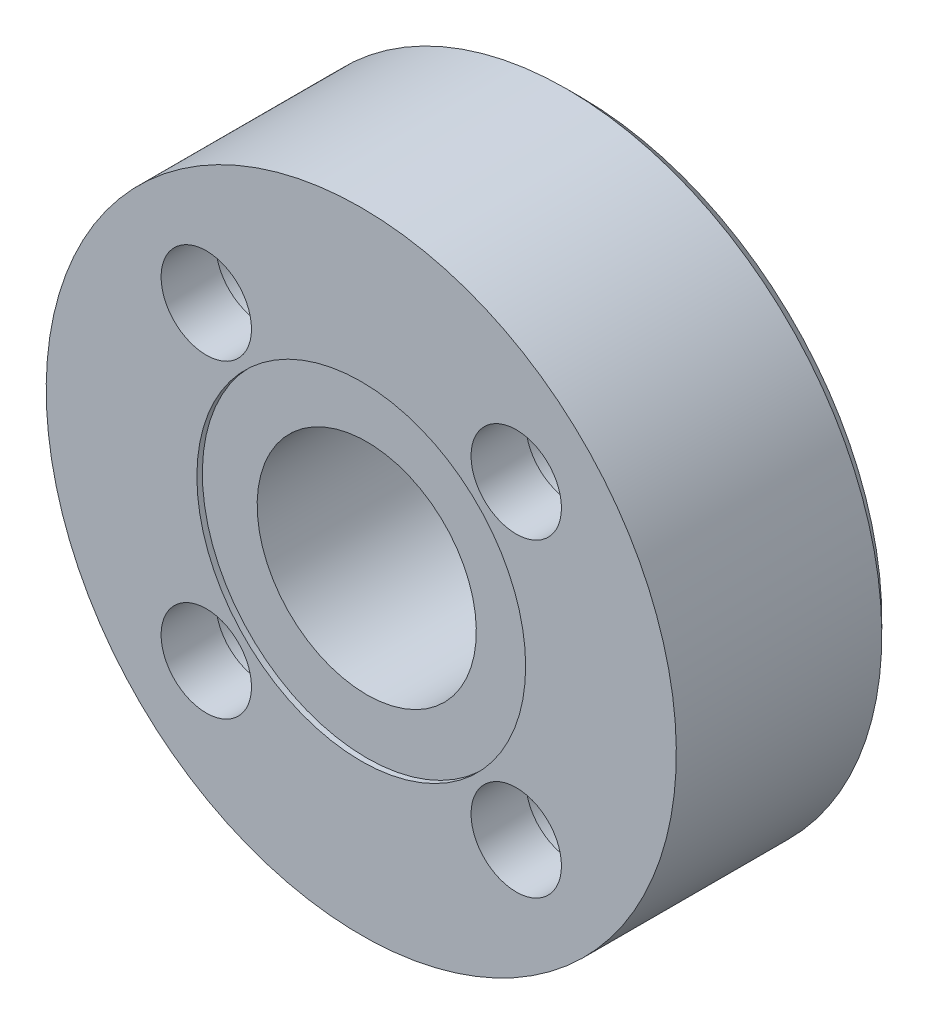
ISO-10303-21;
HEADER;
FILE_DESCRIPTION(('STEP AP214'),'2;1');
FILE_NAME('part.step','',(''),(''),'','','');
FILE_SCHEMA(('AUTOMOTIVE_DESIGN { 1 0 10303 214 1 1 1 1 }'));
ENDSEC;
DATA;
#1=APPLICATION_CONTEXT('core data for automotive mechanical design processes');
#2=APPLICATION_PROTOCOL_DEFINITION('international standard','automotive_design',2000,#1);
#3=PRODUCT_CONTEXT('',#1,'mechanical');
#4=PRODUCT('Part','Part','',(#3));
#5=PRODUCT_RELATED_PRODUCT_CATEGORY('part','',(#4));
#6=PRODUCT_DEFINITION_FORMATION('','',#4);
#7=PRODUCT_DEFINITION_CONTEXT('part definition',#1,'design');
#8=PRODUCT_DEFINITION('design','',#6,#7);
#9=PRODUCT_DEFINITION_SHAPE('','',#8);
#10=(LENGTH_UNIT() NAMED_UNIT(*) SI_UNIT(.MILLI.,.METRE.));
#11=(NAMED_UNIT(*) PLANE_ANGLE_UNIT() SI_UNIT($,.RADIAN.));
#12=(NAMED_UNIT(*) SI_UNIT($,.STERADIAN.) SOLID_ANGLE_UNIT());
#13=UNCERTAINTY_MEASURE_WITH_UNIT(LENGTH_MEASURE(1.E-05),#10,'distance_accuracy_value','');
#14=(GEOMETRIC_REPRESENTATION_CONTEXT(3) GLOBAL_UNCERTAINTY_ASSIGNED_CONTEXT((#13)) GLOBAL_UNIT_ASSIGNED_CONTEXT((#10,
#11,#12)) REPRESENTATION_CONTEXT('',''));
#15=CARTESIAN_POINT('',(0.,0.,0.));
#16=DIRECTION('',(0.,0.,1.));
#17=DIRECTION('',(1.,0.,0.));
#18=AXIS2_PLACEMENT_3D('',#15,#16,#17);
#19=CARTESIAN_POINT('',(-5.65685424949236,5.6568542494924,0.));
#20=DIRECTION('',(0.,0.,-1.));
#21=DIRECTION('',(0.,-1.,0.));
#22=AXIS2_PLACEMENT_3D('',#19,#20,#21);
#23=CYLINDRICAL_SURFACE('',#22,1.65);
#24=CARTESIAN_POINT('',(-5.65685424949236,5.6568542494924,8.));
#25=DIRECTION('',(0.,0.,-1.));
#26=DIRECTION('',(0.,1.,0.));
#27=AXIS2_PLACEMENT_3D('',#24,#25,#26);
#28=CIRCLE('',#27,1.65);
#29=CARTESIAN_POINT('',(-5.65685424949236,7.3068542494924,8.));
#30=VERTEX_POINT('',#29);
#31=EDGE_CURVE('E375',#30,#30,#28,.F.);
#32=ORIENTED_EDGE('',*,*,#31,.T.);
#33=EDGE_LOOP('',(#32));
#34=FACE_BOUND('',#33,.T.);
#35=CARTESIAN_POINT('',(-5.65685424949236,5.6568542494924,6.));
#36=DIRECTION('',(0.,0.,-1.));
#37=DIRECTION('',(0.,-1.,0.));
#38=AXIS2_PLACEMENT_3D('',#35,#36,#37);
#39=CIRCLE('',#38,1.65);
#40=CARTESIAN_POINT('',(-5.65685424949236,4.0068542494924,6.));
#41=VERTEX_POINT('',#40);
#42=EDGE_CURVE('E58',#41,#41,#39,.F.);
#43=ORIENTED_EDGE('',*,*,#42,.F.);
#44=EDGE_LOOP('',(#43));
#45=FACE_BOUND('',#44,.T.);
#46=ADVANCED_FACE('F12',(#34,#45),#23,.F.);
#47=CARTESIAN_POINT('',(5.65685424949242,5.65685424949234,0.));
#48=DIRECTION('',(0.,0.,-1.));
#49=DIRECTION('',(0.,-1.,0.));
#50=AXIS2_PLACEMENT_3D('',#47,#48,#49);
#51=CYLINDRICAL_SURFACE('',#50,1.65);
#52=CARTESIAN_POINT('',(5.65685424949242,5.65685424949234,8.));
#53=DIRECTION('',(0.,0.,-1.));
#54=DIRECTION('',(0.,1.,0.));
#55=AXIS2_PLACEMENT_3D('',#52,#53,#54);
#56=CIRCLE('',#55,1.65);
#57=CARTESIAN_POINT('',(5.65685424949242,7.30685424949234,8.));
#58=VERTEX_POINT('',#57);
#59=EDGE_CURVE('E382',#58,#58,#56,.F.);
#60=ORIENTED_EDGE('',*,*,#59,.T.);
#61=EDGE_LOOP('',(#60));
#62=FACE_BOUND('',#61,.T.);
#63=CARTESIAN_POINT('',(5.65685424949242,5.65685424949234,6.));
#64=DIRECTION('',(0.,0.,-1.));
#65=DIRECTION('',(0.,-1.,0.));
#66=AXIS2_PLACEMENT_3D('',#63,#64,#65);
#67=CIRCLE('',#66,1.65);
#68=CARTESIAN_POINT('',(5.65685424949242,4.00685424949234,6.));
#69=VERTEX_POINT('',#68);
#70=EDGE_CURVE('E51',#69,#69,#67,.F.);
#71=ORIENTED_EDGE('',*,*,#70,.F.);
#72=EDGE_LOOP('',(#71));
#73=FACE_BOUND('',#72,.T.);
#74=ADVANCED_FACE('F120',(#62,#73),#51,.F.);
#75=CARTESIAN_POINT('',(5.65685424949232,-5.65685424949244,0.));
#76=DIRECTION('',(0.,0.,-1.));
#77=DIRECTION('',(0.,-1.,0.));
#78=AXIS2_PLACEMENT_3D('',#75,#76,#77);
#79=CYLINDRICAL_SURFACE('',#78,1.65);
#80=CARTESIAN_POINT('',(5.65685424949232,-5.65685424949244,8.));
#81=DIRECTION('',(0.,0.,-1.));
#82=DIRECTION('',(0.,1.,0.));
#83=AXIS2_PLACEMENT_3D('',#80,#81,#82);
#84=CIRCLE('',#83,1.65);
#85=CARTESIAN_POINT('',(5.65685424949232,-4.00685424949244,8.));
#86=VERTEX_POINT('',#85);
#87=EDGE_CURVE('E379',#86,#86,#84,.F.);
#88=ORIENTED_EDGE('',*,*,#87,.T.);
#89=EDGE_LOOP('',(#88));
#90=FACE_BOUND('',#89,.T.);
#91=CARTESIAN_POINT('',(5.65685424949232,-5.65685424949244,6.));
#92=DIRECTION('',(0.,0.,-1.));
#93=DIRECTION('',(0.,-1.,0.));
#94=AXIS2_PLACEMENT_3D('',#91,#92,#93);
#95=CIRCLE('',#94,1.65);
#96=CARTESIAN_POINT('',(5.65685424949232,-7.30685424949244,6.));
#97=VERTEX_POINT('',#96);
#98=EDGE_CURVE('E44',#97,#97,#95,.F.);
#99=ORIENTED_EDGE('',*,*,#98,.F.);
#100=EDGE_LOOP('',(#99));
#101=FACE_BOUND('',#100,.T.);
#102=ADVANCED_FACE('F116',(#90,#101),#79,.F.);
#103=CARTESIAN_POINT('',(-5.65685424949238,-5.65685424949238,0.));
#104=DIRECTION('',(0.,0.,-1.));
#105=DIRECTION('',(0.,-1.,0.));
#106=AXIS2_PLACEMENT_3D('',#103,#104,#105);
#107=CYLINDRICAL_SURFACE('',#106,1.65);
#108=CARTESIAN_POINT('',(-5.65685424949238,-5.65685424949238,8.));
#109=DIRECTION('',(0.,0.,-1.));
#110=DIRECTION('',(0.,1.,0.));
#111=AXIS2_PLACEMENT_3D('',#108,#109,#110);
#112=CIRCLE('',#111,1.65);
#113=CARTESIAN_POINT('',(-5.65685424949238,-4.00685424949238,8.));
#114=VERTEX_POINT('',#113);
#115=EDGE_CURVE('E368',#114,#114,#112,.F.);
#116=ORIENTED_EDGE('',*,*,#115,.T.);
#117=EDGE_LOOP('',(#116));
#118=FACE_BOUND('',#117,.T.);
#119=CARTESIAN_POINT('',(-5.65685424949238,-5.65685424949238,6.));
#120=DIRECTION('',(0.,0.,-1.));
#121=DIRECTION('',(0.,-1.,0.));
#122=AXIS2_PLACEMENT_3D('',#119,#120,#121);
#123=CIRCLE('',#122,1.65);
#124=CARTESIAN_POINT('',(-5.65685424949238,-7.30685424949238,6.));
#125=VERTEX_POINT('',#124);
#126=EDGE_CURVE('E37',#125,#125,#123,.F.);
#127=ORIENTED_EDGE('',*,*,#126,.F.);
#128=EDGE_LOOP('',(#127));
#129=FACE_BOUND('',#128,.T.);
#130=ADVANCED_FACE('F107',(#118,#129),#107,.F.);
#131=CARTESIAN_POINT('',(0.,0.,0.));
#132=DIRECTION('',(0.,0.,-1.));
#133=DIRECTION('',(0.,-1.,0.));
#134=AXIS2_PLACEMENT_3D('',#131,#132,#133);
#135=CYLINDRICAL_SURFACE('',#134,4.);
#136=CARTESIAN_POINT('',(0.,0.,7.8));
#137=DIRECTION('',(0.,0.,-1.));
#138=DIRECTION('',(0.,-1.,0.));
#139=AXIS2_PLACEMENT_3D('',#136,#137,#138);
#140=CIRCLE('',#139,4.);
#141=CARTESIAN_POINT('',(0.,-4.,7.8));
#142=VERTEX_POINT('',#141);
#143=EDGE_CURVE('E32',#142,#142,#140,.F.);
#144=ORIENTED_EDGE('',*,*,#143,.T.);
#145=EDGE_LOOP('',(#144));
#146=FACE_BOUND('',#145,.T.);
#147=CARTESIAN_POINT('',(0.,0.,0.5));
#148=DIRECTION('',(0.,0.,1.));
#149=DIRECTION('',(0.,1.,0.));
#150=AXIS2_PLACEMENT_3D('',#147,#148,#149);
#151=CIRCLE('',#150,4.);
#152=CARTESIAN_POINT('',(0.,4.,0.5));
#153=VERTEX_POINT('',#152);
#154=EDGE_CURVE('E89',#153,#153,#151,.F.);
#155=ORIENTED_EDGE('',*,*,#154,.T.);
#156=EDGE_LOOP('',(#155));
#157=FACE_BOUND('',#156,.T.);
#158=ADVANCED_FACE('F14',(#146,#157),#135,.F.);
#159=CARTESIAN_POINT('',(0.,0.,0.));
#160=DIRECTION('',(0.,0.,-1.));
#161=DIRECTION('',(0.,-1.,0.));
#162=AXIS2_PLACEMENT_3D('',#159,#160,#161);
#163=CYLINDRICAL_SURFACE('',#162,11.5);
#164=CARTESIAN_POINT('',(0.,0.,0.5));
#165=DIRECTION('',(0.,0.,1.));
#166=DIRECTION('',(0.,1.,0.));
#167=AXIS2_PLACEMENT_3D('',#164,#165,#166);
#168=CIRCLE('',#167,11.5);
#169=CARTESIAN_POINT('',(0.,11.5,0.5));
#170=VERTEX_POINT('',#169);
#171=EDGE_CURVE('E19',#170,#170,#168,.T.);
#172=ORIENTED_EDGE('',*,*,#171,.T.);
#173=EDGE_LOOP('',(#172));
#174=FACE_BOUND('',#173,.T.);
#175=CARTESIAN_POINT('',(0.,0.,8.));
#176=DIRECTION('',(0.,0.,-1.));
#177=DIRECTION('',(0.,1.,0.));
#178=AXIS2_PLACEMENT_3D('',#175,#176,#177);
#179=CIRCLE('',#178,11.5);
#180=CARTESIAN_POINT('',(0.,11.5,8.));
#181=VERTEX_POINT('',#180);
#182=EDGE_CURVE('E372',#181,#181,#179,.T.);
#183=ORIENTED_EDGE('',*,*,#182,.T.);
#184=EDGE_LOOP('',(#183));
#185=FACE_BOUND('',#184,.T.);
#186=ADVANCED_FACE('F106',(#174,#185),#163,.T.);
#187=CARTESIAN_POINT('',(0.,4.,0.));
#188=DIRECTION('',(0.,0.,1.));
#189=DIRECTION('',(0.,1.,0.));
#190=AXIS2_PLACEMENT_3D('',#187,#188,#189);
#191=PLANE('',#190);
#192=CARTESIAN_POINT('',(0.,0.,0.));
#193=DIRECTION('',(0.,0.,1.));
#194=DIRECTION('',(0.,1.,0.));
#195=AXIS2_PLACEMENT_3D('',#192,#193,#194);
#196=CIRCLE('',#195,11.);
#197=CARTESIAN_POINT('',(0.,11.,0.));
#198=VERTEX_POINT('',#197);
#199=EDGE_CURVE('E23',#198,#198,#196,.F.);
#200=ORIENTED_EDGE('',*,*,#199,.T.);
#201=EDGE_LOOP('',(#200));
#202=FACE_BOUND('',#201,.T.);
#203=CARTESIAN_POINT('',(0.,0.,0.));
#204=DIRECTION('',(0.,0.,1.));
#205=DIRECTION('',(0.,1.,0.));
#206=AXIS2_PLACEMENT_3D('',#203,#204,#205);
#207=CIRCLE('',#206,4.5);
#208=CARTESIAN_POINT('',(0.,4.5,0.));
#209=VERTEX_POINT('',#208);
#210=EDGE_CURVE('E28',#209,#209,#207,.T.);
#211=ORIENTED_EDGE('',*,*,#210,.T.);
#212=EDGE_LOOP('',(#211));
#213=FACE_BOUND('',#212,.T.);
#214=CARTESIAN_POINT('',(5.65685424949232,-5.65685424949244,0.));
#215=DIRECTION('',(0.,0.,-1.));
#216=DIRECTION('',(0.,-1.,0.));
#217=AXIS2_PLACEMENT_3D('',#214,#215,#216);
#218=CIRCLE('',#217,2.35);
#219=CARTESIAN_POINT('',(5.65685424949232,-8.00685424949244,0.));
#220=VERTEX_POINT('',#219);
#221=EDGE_CURVE('E35',#220,#220,#218,.T.);
#222=ORIENTED_EDGE('',*,*,#221,.F.);
#223=EDGE_LOOP('',(#222));
#224=FACE_BOUND('',#223,.T.);
#225=CARTESIAN_POINT('',(5.65685424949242,5.65685424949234,0.));
#226=DIRECTION('',(0.,0.,-1.));
#227=DIRECTION('',(0.,-1.,0.));
#228=AXIS2_PLACEMENT_3D('',#225,#226,#227);
#229=CIRCLE('',#228,2.35);
#230=CARTESIAN_POINT('',(5.65685424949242,3.30685424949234,0.));
#231=VERTEX_POINT('',#230);
#232=EDGE_CURVE('E80',#231,#231,#229,.T.);
#233=ORIENTED_EDGE('',*,*,#232,.F.);
#234=EDGE_LOOP('',(#233));
#235=FACE_BOUND('',#234,.T.);
#236=CARTESIAN_POINT('',(-5.65685424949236,5.6568542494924,0.));
#237=DIRECTION('',(0.,0.,-1.));
#238=DIRECTION('',(0.,-1.,0.));
#239=AXIS2_PLACEMENT_3D('',#236,#237,#238);
#240=CIRCLE('',#239,2.35);
#241=CARTESIAN_POINT('',(-5.65685424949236,3.3068542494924,0.));
#242=VERTEX_POINT('',#241);
#243=EDGE_CURVE('E83',#242,#242,#240,.T.);
#244=ORIENTED_EDGE('',*,*,#243,.F.);
#245=EDGE_LOOP('',(#244));
#246=FACE_BOUND('',#245,.T.);
#247=CARTESIAN_POINT('',(-5.65685424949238,-5.65685424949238,0.));
#248=DIRECTION('',(0.,0.,-1.));
#249=DIRECTION('',(0.,-1.,0.));
#250=AXIS2_PLACEMENT_3D('',#247,#248,#249);
#251=CIRCLE('',#250,2.35);
#252=CARTESIAN_POINT('',(-5.65685424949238,-8.00685424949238,0.));
#253=VERTEX_POINT('',#252);
#254=EDGE_CURVE('E86',#253,#253,#251,.T.);
#255=ORIENTED_EDGE('',*,*,#254,.F.);
#256=EDGE_LOOP('',(#255));
#257=FACE_BOUND('',#256,.T.);
#258=ADVANCED_FACE('F94',(#202,#213,#224,#235,#246,#257),#191,.F.);
#259=CARTESIAN_POINT('',(-5.65685424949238,-5.65685424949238,0.));
#260=DIRECTION('',(0.,0.,-1.));
#261=DIRECTION('',(0.,-1.,0.));
#262=AXIS2_PLACEMENT_3D('',#259,#260,#261);
#263=CONICAL_SURFACE('',#262,2.35,0.785398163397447);
#264=CARTESIAN_POINT('',(-5.65685424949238,-5.65685424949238,0.35));
#265=DIRECTION('',(0.,0.,-1.));
#266=DIRECTION('',(0.,-1.,0.));
#267=AXIS2_PLACEMENT_3D('',#264,#265,#266);
#268=CIRCLE('',#267,2.);
#269=CARTESIAN_POINT('',(-5.65685424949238,-7.65685424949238,0.35));
#270=VERTEX_POINT('',#269);
#271=EDGE_CURVE('E40',#270,#270,#268,.F.);
#272=ORIENTED_EDGE('',*,*,#271,.T.);
#273=EDGE_LOOP('',(#272));
#274=FACE_BOUND('',#273,.T.);
#275=ORIENTED_EDGE('',*,*,#254,.T.);
#276=EDGE_LOOP('',(#275));
#277=FACE_BOUND('',#276,.T.);
#278=ADVANCED_FACE('F136',(#274,#277),#263,.F.);
#279=CARTESIAN_POINT('',(-5.65685424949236,5.6568542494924,0.));
#280=DIRECTION('',(0.,0.,-1.));
#281=DIRECTION('',(0.,-1.,0.));
#282=AXIS2_PLACEMENT_3D('',#279,#280,#281);
#283=CONICAL_SURFACE('',#282,2.35,0.785398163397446);
#284=CARTESIAN_POINT('',(-5.65685424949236,5.6568542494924,0.35));
#285=DIRECTION('',(0.,0.,-1.));
#286=DIRECTION('',(0.,-1.,0.));
#287=AXIS2_PLACEMENT_3D('',#284,#285,#286);
#288=CIRCLE('',#287,2.);
#289=CARTESIAN_POINT('',(-5.65685424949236,3.6568542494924,0.35));
#290=VERTEX_POINT('',#289);
#291=EDGE_CURVE('E60',#290,#290,#288,.F.);
#292=ORIENTED_EDGE('',*,*,#291,.T.);
#293=EDGE_LOOP('',(#292));
#294=FACE_BOUND('',#293,.T.);
#295=ORIENTED_EDGE('',*,*,#243,.T.);
#296=EDGE_LOOP('',(#295));
#297=FACE_BOUND('',#296,.T.);
#298=ADVANCED_FACE('F134',(#294,#297),#283,.F.);
#299=CARTESIAN_POINT('',(5.65685424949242,5.65685424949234,0.));
#300=DIRECTION('',(0.,0.,-1.));
#301=DIRECTION('',(0.,-1.,0.));
#302=AXIS2_PLACEMENT_3D('',#299,#300,#301);
#303=CONICAL_SURFACE('',#302,2.35,0.785398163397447);
#304=CARTESIAN_POINT('',(5.65685424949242,5.65685424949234,0.35));
#305=DIRECTION('',(0.,0.,-1.));
#306=DIRECTION('',(0.,-1.,0.));
#307=AXIS2_PLACEMENT_3D('',#304,#305,#306);
#308=CIRCLE('',#307,2.);
#309=CARTESIAN_POINT('',(5.65685424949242,3.65685424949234,0.35));
#310=VERTEX_POINT('',#309);
#311=EDGE_CURVE('E54',#310,#310,#308,.F.);
#312=ORIENTED_EDGE('',*,*,#311,.T.);
#313=EDGE_LOOP('',(#312));
#314=FACE_BOUND('',#313,.T.);
#315=ORIENTED_EDGE('',*,*,#232,.T.);
#316=EDGE_LOOP('',(#315));
#317=FACE_BOUND('',#316,.T.);
#318=ADVANCED_FACE('F133',(#314,#317),#303,.F.);
#319=CARTESIAN_POINT('',(5.65685424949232,-5.65685424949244,0.));
#320=DIRECTION('',(0.,0.,-1.));
#321=DIRECTION('',(0.,-1.,0.));
#322=AXIS2_PLACEMENT_3D('',#319,#320,#321);
#323=CONICAL_SURFACE('',#322,2.35,0.785398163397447);
#324=CARTESIAN_POINT('',(5.65685424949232,-5.65685424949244,0.35));
#325=DIRECTION('',(0.,0.,-1.));
#326=DIRECTION('',(0.,-1.,0.));
#327=AXIS2_PLACEMENT_3D('',#324,#325,#326);
#328=CIRCLE('',#327,2.);
#329=CARTESIAN_POINT('',(5.65685424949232,-7.65685424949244,0.35));
#330=VERTEX_POINT('',#329);
#331=EDGE_CURVE('E47',#330,#330,#328,.F.);
#332=ORIENTED_EDGE('',*,*,#331,.T.);
#333=EDGE_LOOP('',(#332));
#334=FACE_BOUND('',#333,.T.);
#335=ORIENTED_EDGE('',*,*,#221,.T.);
#336=EDGE_LOOP('',(#335));
#337=FACE_BOUND('',#336,.T.);
#338=ADVANCED_FACE('F101',(#334,#337),#323,.F.);
#339=CARTESIAN_POINT('',(0.,0.,0.5));
#340=DIRECTION('',(0.,0.,-1.));
#341=DIRECTION('',(0.,-1.,0.));
#342=AXIS2_PLACEMENT_3D('',#339,#340,#341);
#343=CONICAL_SURFACE('',#342,4.,0.78539816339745);
#344=ORIENTED_EDGE('',*,*,#210,.F.);
#345=EDGE_LOOP('',(#344));
#346=FACE_BOUND('',#345,.T.);
#347=ORIENTED_EDGE('',*,*,#154,.F.);
#348=EDGE_LOOP('',(#347));
#349=FACE_BOUND('',#348,.T.);
#350=ADVANCED_FACE('F97',(#346,#349),#343,.F.);
#351=CARTESIAN_POINT('',(0.,0.,0.));
#352=DIRECTION('',(0.,0.,1.));
#353=DIRECTION('',(0.,1.,0.));
#354=AXIS2_PLACEMENT_3D('',#351,#352,#353);
#355=CONICAL_SURFACE('',#354,11.,0.785398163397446);
#356=ORIENTED_EDGE('',*,*,#171,.F.);
#357=EDGE_LOOP('',(#356));
#358=FACE_BOUND('',#357,.T.);
#359=ORIENTED_EDGE('',*,*,#199,.F.);
#360=EDGE_LOOP('',(#359));
#361=FACE_BOUND('',#360,.T.);
#362=ADVANCED_FACE('F100',(#358,#361),#355,.T.);
#363=CARTESIAN_POINT('',(0.,0.,7.8));
#364=DIRECTION('',(0.,0.,-1.));
#365=DIRECTION('',(0.,-1.,0.));
#366=AXIS2_PLACEMENT_3D('',#363,#364,#365);
#367=PLANE('',#366);
#368=CARTESIAN_POINT('',(0.,0.,7.8));
#369=DIRECTION('',(0.,0.,-1.));
#370=DIRECTION('',(0.,-1.,0.));
#371=AXIS2_PLACEMENT_3D('',#368,#369,#370);
#372=CIRCLE('',#371,6.);
#373=CARTESIAN_POINT('',(0.,-6.,7.8));
#374=VERTEX_POINT('',#373);
#375=EDGE_CURVE('E36',#374,#374,#372,.T.);
#376=ORIENTED_EDGE('',*,*,#375,.F.);
#377=EDGE_LOOP('',(#376));
#378=FACE_BOUND('',#377,.T.);
#379=ORIENTED_EDGE('',*,*,#143,.F.);
#380=EDGE_LOOP('',(#379));
#381=FACE_BOUND('',#380,.T.);
#382=ADVANCED_FACE('F148',(#378,#381),#367,.F.);
#383=CARTESIAN_POINT('',(0.,0.,17.8));
#384=DIRECTION('',(0.,0.,-1.));
#385=DIRECTION('',(0.,-1.,0.));
#386=AXIS2_PLACEMENT_3D('',#383,#384,#385);
#387=CYLINDRICAL_SURFACE('',#386,6.);
#388=ORIENTED_EDGE('',*,*,#375,.T.);
#389=EDGE_LOOP('',(#388));
#390=FACE_BOUND('',#389,.T.);
#391=CARTESIAN_POINT('',(0.,0.,8.));
#392=DIRECTION('',(0.,0.,-1.));
#393=DIRECTION('',(0.,1.,0.));
#394=AXIS2_PLACEMENT_3D('',#391,#392,#393);
#395=CIRCLE('',#394,6.);
#396=CARTESIAN_POINT('',(0.,6.,8.));
#397=VERTEX_POINT('',#396);
#398=EDGE_CURVE('E8',#397,#397,#395,.F.);
#399=ORIENTED_EDGE('',*,*,#398,.T.);
#400=EDGE_LOOP('',(#399));
#401=FACE_BOUND('',#400,.T.);
#402=ADVANCED_FACE('F155',(#390,#401),#387,.F.);
#403=CARTESIAN_POINT('',(-5.65685424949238,-5.65685424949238,6.));
#404=DIRECTION('',(0.,0.,-1.));
#405=DIRECTION('',(0.,-1.,0.));
#406=AXIS2_PLACEMENT_3D('',#403,#404,#405);
#407=CYLINDRICAL_SURFACE('',#406,2.);
#408=CARTESIAN_POINT('',(-5.65685424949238,-5.65685424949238,6.));
#409=DIRECTION('',(0.,0.,-1.));
#410=DIRECTION('',(0.,-1.,0.));
#411=AXIS2_PLACEMENT_3D('',#408,#409,#410);
#412=CIRCLE('',#411,2.);
#413=CARTESIAN_POINT('',(-5.65685424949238,-7.65685424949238,6.));
#414=VERTEX_POINT('',#413);
#415=EDGE_CURVE('E41',#414,#414,#412,.T.);
#416=ORIENTED_EDGE('',*,*,#415,.F.);
#417=EDGE_LOOP('',(#416));
#418=FACE_BOUND('',#417,.T.);
#419=ORIENTED_EDGE('',*,*,#271,.F.);
#420=EDGE_LOOP('',(#419));
#421=FACE_BOUND('',#420,.T.);
#422=ADVANCED_FACE('F197',(#418,#421),#407,.F.);
#423=CARTESIAN_POINT('',(-5.65685424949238,-5.65685424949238,6.));
#424=DIRECTION('',(0.,0.,-1.));
#425=DIRECTION('',(0.,-1.,0.));
#426=AXIS2_PLACEMENT_3D('',#423,#424,#425);
#427=PLANE('',#426);
#428=ORIENTED_EDGE('',*,*,#415,.T.);
#429=EDGE_LOOP('',(#428));
#430=FACE_BOUND('',#429,.T.);
#431=ORIENTED_EDGE('',*,*,#126,.T.);
#432=EDGE_LOOP('',(#431));
#433=FACE_BOUND('',#432,.T.);
#434=ADVANCED_FACE('F186',(#430,#433),#427,.T.);
#435=CARTESIAN_POINT('',(5.65685424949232,-5.65685424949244,6.));
#436=DIRECTION('',(0.,0.,-1.));
#437=DIRECTION('',(0.,-1.,0.));
#438=AXIS2_PLACEMENT_3D('',#435,#436,#437);
#439=CYLINDRICAL_SURFACE('',#438,2.);
#440=CARTESIAN_POINT('',(5.65685424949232,-5.65685424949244,6.));
#441=DIRECTION('',(0.,0.,-1.));
#442=DIRECTION('',(0.,-1.,0.));
#443=AXIS2_PLACEMENT_3D('',#440,#441,#442);
#444=CIRCLE('',#443,2.);
#445=CARTESIAN_POINT('',(5.65685424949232,-7.65685424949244,6.));
#446=VERTEX_POINT('',#445);
#447=EDGE_CURVE('E48',#446,#446,#444,.T.);
#448=ORIENTED_EDGE('',*,*,#447,.F.);
#449=EDGE_LOOP('',(#448));
#450=FACE_BOUND('',#449,.T.);
#451=ORIENTED_EDGE('',*,*,#331,.F.);
#452=EDGE_LOOP('',(#451));
#453=FACE_BOUND('',#452,.T.);
#454=ADVANCED_FACE('F183',(#450,#453),#439,.F.);
#455=CARTESIAN_POINT('',(5.65685424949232,-5.65685424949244,6.));
#456=DIRECTION('',(0.,0.,-1.));
#457=DIRECTION('',(0.,-1.,0.));
#458=AXIS2_PLACEMENT_3D('',#455,#456,#457);
#459=PLANE('',#458);
#460=ORIENTED_EDGE('',*,*,#447,.T.);
#461=EDGE_LOOP('',(#460));
#462=FACE_BOUND('',#461,.T.);
#463=ORIENTED_EDGE('',*,*,#98,.T.);
#464=EDGE_LOOP('',(#463));
#465=FACE_BOUND('',#464,.T.);
#466=ADVANCED_FACE('F185',(#462,#465),#459,.T.);
#467=CARTESIAN_POINT('',(5.65685424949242,5.65685424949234,6.));
#468=DIRECTION('',(0.,0.,-1.));
#469=DIRECTION('',(0.,-1.,0.));
#470=AXIS2_PLACEMENT_3D('',#467,#468,#469);
#471=CYLINDRICAL_SURFACE('',#470,2.);
#472=CARTESIAN_POINT('',(5.65685424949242,5.65685424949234,6.));
#473=DIRECTION('',(0.,0.,-1.));
#474=DIRECTION('',(0.,-1.,0.));
#475=AXIS2_PLACEMENT_3D('',#472,#473,#474);
#476=CIRCLE('',#475,2.);
#477=CARTESIAN_POINT('',(5.65685424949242,3.65685424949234,6.));
#478=VERTEX_POINT('',#477);
#479=EDGE_CURVE('E55',#478,#478,#476,.T.);
#480=ORIENTED_EDGE('',*,*,#479,.F.);
#481=EDGE_LOOP('',(#480));
#482=FACE_BOUND('',#481,.T.);
#483=ORIENTED_EDGE('',*,*,#311,.F.);
#484=EDGE_LOOP('',(#483));
#485=FACE_BOUND('',#484,.T.);
#486=ADVANCED_FACE('F194',(#482,#485),#471,.F.);
#487=CARTESIAN_POINT('',(5.65685424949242,5.65685424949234,6.));
#488=DIRECTION('',(0.,0.,-1.));
#489=DIRECTION('',(0.,-1.,0.));
#490=AXIS2_PLACEMENT_3D('',#487,#488,#489);
#491=PLANE('',#490);
#492=ORIENTED_EDGE('',*,*,#479,.T.);
#493=EDGE_LOOP('',(#492));
#494=FACE_BOUND('',#493,.T.);
#495=ORIENTED_EDGE('',*,*,#70,.T.);
#496=EDGE_LOOP('',(#495));
#497=FACE_BOUND('',#496,.T.);
#498=ADVANCED_FACE('F320',(#494,#497),#491,.T.);
#499=CARTESIAN_POINT('',(-5.65685424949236,5.6568542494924,6.));
#500=DIRECTION('',(0.,0.,-1.));
#501=DIRECTION('',(0.,-1.,0.));
#502=AXIS2_PLACEMENT_3D('',#499,#500,#501);
#503=CYLINDRICAL_SURFACE('',#502,2.);
#504=CARTESIAN_POINT('',(-5.65685424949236,5.6568542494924,6.));
#505=DIRECTION('',(0.,0.,-1.));
#506=DIRECTION('',(0.,-1.,0.));
#507=AXIS2_PLACEMENT_3D('',#504,#505,#506);
#508=CIRCLE('',#507,2.);
#509=CARTESIAN_POINT('',(-5.65685424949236,3.6568542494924,6.));
#510=VERTEX_POINT('',#509);
#511=EDGE_CURVE('E61',#510,#510,#508,.T.);
#512=ORIENTED_EDGE('',*,*,#511,.F.);
#513=EDGE_LOOP('',(#512));
#514=FACE_BOUND('',#513,.T.);
#515=ORIENTED_EDGE('',*,*,#291,.F.);
#516=EDGE_LOOP('',(#515));
#517=FACE_BOUND('',#516,.T.);
#518=ADVANCED_FACE('F327',(#514,#517),#503,.F.);
#519=CARTESIAN_POINT('',(-5.65685424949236,5.6568542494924,6.));
#520=DIRECTION('',(0.,0.,-1.));
#521=DIRECTION('',(0.,-1.,0.));
#522=AXIS2_PLACEMENT_3D('',#519,#520,#521);
#523=PLANE('',#522);
#524=ORIENTED_EDGE('',*,*,#511,.T.);
#525=EDGE_LOOP('',(#524));
#526=FACE_BOUND('',#525,.T.);
#527=ORIENTED_EDGE('',*,*,#42,.T.);
#528=EDGE_LOOP('',(#527));
#529=FACE_BOUND('',#528,.T.);
#530=ADVANCED_FACE('F334',(#526,#529),#523,.T.);
#531=CARTESIAN_POINT('',(-15.,15.5876402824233,8.));
#532=DIRECTION('',(0.,0.,-1.));
#533=DIRECTION('',(0.,1.,0.));
#534=AXIS2_PLACEMENT_3D('',#531,#532,#533);
#535=PLANE('',#534);
#536=ORIENTED_EDGE('',*,*,#398,.F.);
#537=EDGE_LOOP('',(#536));
#538=FACE_BOUND('',#537,.T.);
#539=ORIENTED_EDGE('',*,*,#115,.F.);
#540=EDGE_LOOP('',(#539));
#541=FACE_BOUND('',#540,.T.);
#542=ORIENTED_EDGE('',*,*,#182,.F.);
#543=EDGE_LOOP('',(#542));
#544=FACE_BOUND('',#543,.T.);
#545=ORIENTED_EDGE('',*,*,#31,.F.);
#546=EDGE_LOOP('',(#545));
#547=FACE_BOUND('',#546,.T.);
#548=ORIENTED_EDGE('',*,*,#87,.F.);
#549=EDGE_LOOP('',(#548));
#550=FACE_BOUND('',#549,.T.);
#551=ORIENTED_EDGE('',*,*,#59,.F.);
#552=EDGE_LOOP('',(#551));
#553=FACE_BOUND('',#552,.T.);
#554=ADVANCED_FACE('F342',(#538,#541,#544,#547,#550,#553),#535,.F.);
#555=CLOSED_SHELL('',(#46,#74,#102,#130,#158,#186,#258,#278,#298,#318,#338,#350,#362,#382,#402,
#422,#434,#454,#466,#486,#498,#518,#530,#554));
#556=MANIFOLD_SOLID_BREP('B1',#555);
#557=ADVANCED_BREP_SHAPE_REPRESENTATION('',(#18,#556),#14);
#558=SHAPE_DEFINITION_REPRESENTATION(#9,#557);
ENDSEC;
END-ISO-10303-21;
